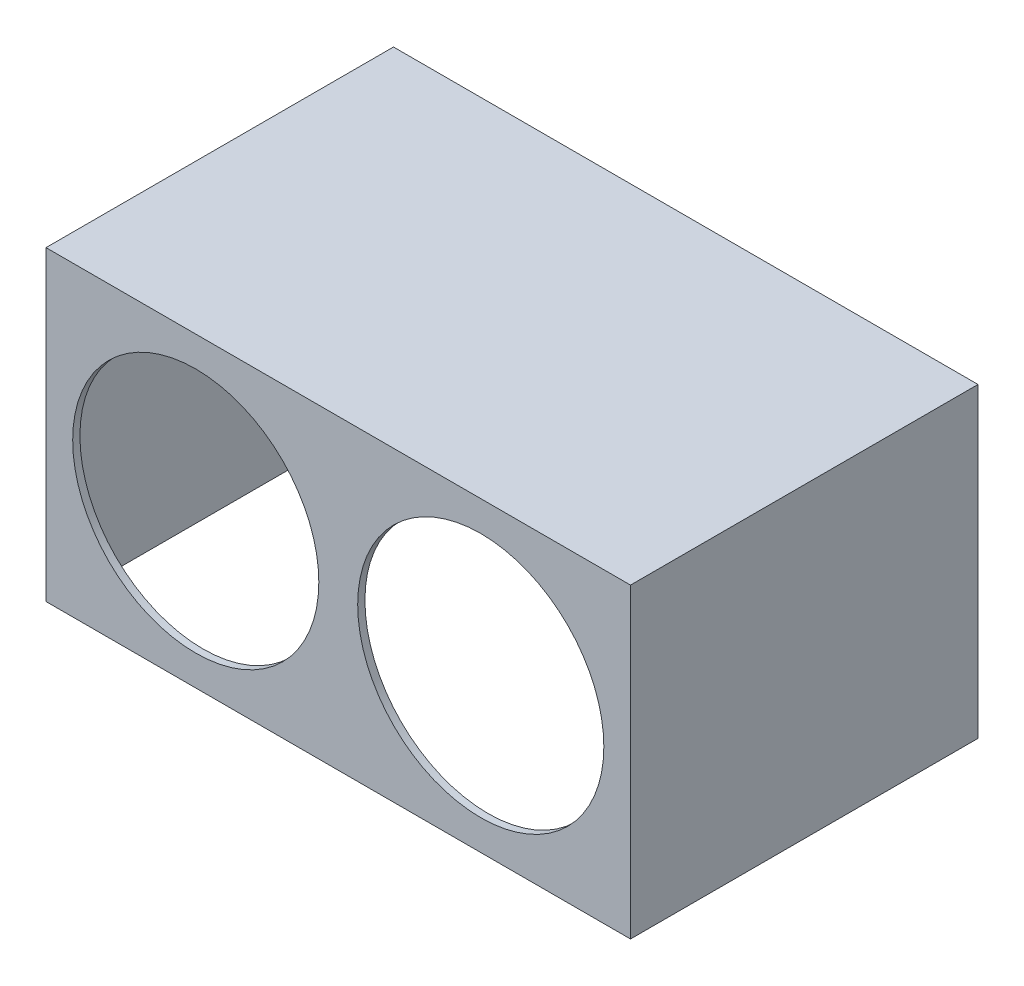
from build123d import *

# Parameters (mm, degrees)
SKETCH3_R          = 215.9
CUT_EXTRUDE4_DEPTH = 841.689977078
SKETCH8_W          = 1000
SKETCH8_H          = 512.318
CUT_EXTRUDE5_DEPTH = 596.9
SKETCH10_W         = 1000
SKETCH10_H         = 665.740076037
CUT_EXTRUDE6_DEPTH = 50


with BuildPart() as part:
    # Sketch2 → Loft2 section 0
    with BuildSketch(Plane.XY.offset(-609.6)):
        with BuildLine():
            Line((-512.701, 268.859), (512.699, 268.859))
            Line((512.699, 268.859), (512.699, -268.859))
            Line((512.699, -268.859), (-512.701, -268.859))
            Line((-512.701, -268.859), (-512.701, 268.859))
        make_face()
    # Sketch1 → Loft2 section 1
    with BuildSketch(Plane.XY):
        with BuildLine():
            Line((512.699, 268.859), (-512.701, 268.859))
            Line((-512.701, 268.859), (-512.701, -268.859))
            Line((-512.701, -268.859), (512.699, -268.859))
            Line((512.699, -268.859), (512.699, 268.859))
        make_face()
    loft()

    # Sketch3 → Cut-Extrude4 (cut, through all)
    with BuildSketch(Plane(origin=(0, 0, 0), x_dir=(-1, 0, 0), z_dir=(0, 0, -1))):
        with Locations(Location((-250, 0, 0), (0, 0, 180))):
            Circle(SKETCH3_R)
        with Locations(Location((250, 0, 0), (0, 0, 180))):
            Circle(SKETCH3_R)
    extrude(amount=CUT_EXTRUDE4_DEPTH, mode=Mode.SUBTRACT)

    # Sketch8 → Cut-Extrude5 (cut)
    with BuildSketch(Plane(origin=(0, 0, -609.6), x_dir=(-1, 0, 0), z_dir=(0, 0, -1))):
        with Locations((0.001, 0)):
            Rectangle(SKETCH8_W, SKETCH8_H)
    extrude(amount=-CUT_EXTRUDE5_DEPTH, mode=Mode.SUBTRACT)

    # Sketch10 → Cut-Extrude6 (cut)
    with BuildSketch(Plane(origin=(0, -256.159, 0), x_dir=(1, 0, 0), z_dir=(0, 1, 0))):
        with Locations((-0.001, 345.570038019)):
            Rectangle(SKETCH10_W, SKETCH10_H)
    extrude(amount=-CUT_EXTRUDE6_DEPTH, mode=Mode.SUBTRACT)


solid = part.part
